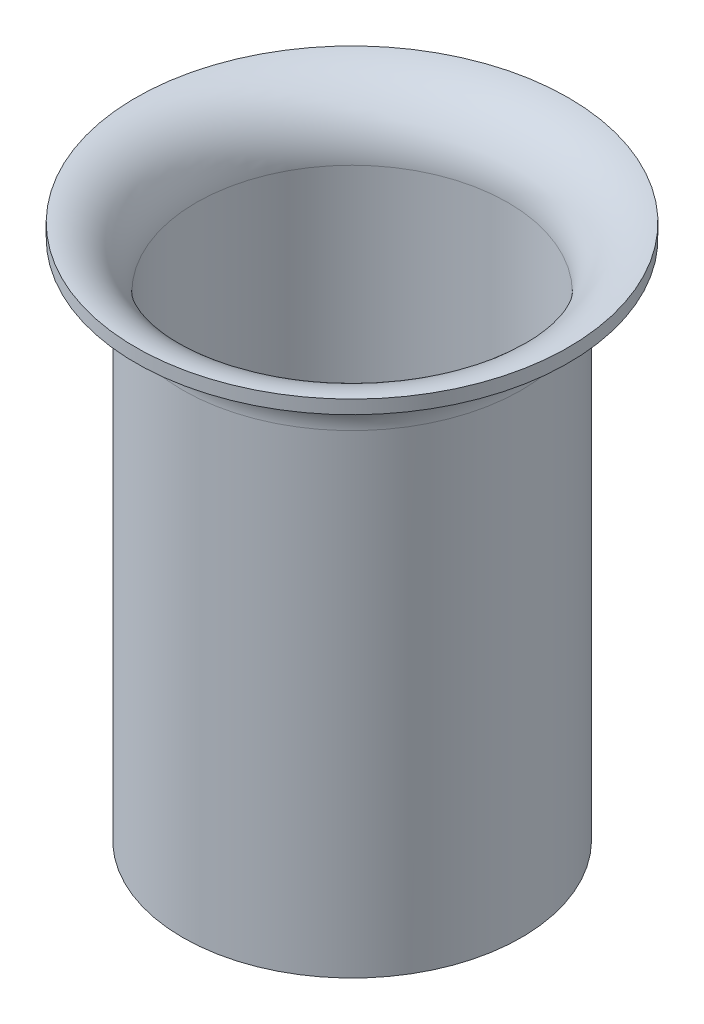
ISO-10303-21;
HEADER;
FILE_DESCRIPTION(('STEP AP214'),'2;1');
FILE_NAME('part.step','',(''),(''),'','','');
FILE_SCHEMA(('AUTOMOTIVE_DESIGN { 1 0 10303 214 1 1 1 1 }'));
ENDSEC;
DATA;
#1=APPLICATION_CONTEXT('core data for automotive mechanical design processes');
#2=APPLICATION_PROTOCOL_DEFINITION('international standard','automotive_design',2000,#1);
#3=PRODUCT_CONTEXT('',#1,'mechanical');
#4=PRODUCT('Part','Part','',(#3));
#5=PRODUCT_RELATED_PRODUCT_CATEGORY('part','',(#4));
#6=PRODUCT_DEFINITION_FORMATION('','',#4);
#7=PRODUCT_DEFINITION_CONTEXT('part definition',#1,'design');
#8=PRODUCT_DEFINITION('design','',#6,#7);
#9=PRODUCT_DEFINITION_SHAPE('','',#8);
#10=(LENGTH_UNIT() NAMED_UNIT(*) SI_UNIT(.MILLI.,.METRE.));
#11=(NAMED_UNIT(*) PLANE_ANGLE_UNIT() SI_UNIT($,.RADIAN.));
#12=(NAMED_UNIT(*) SI_UNIT($,.STERADIAN.) SOLID_ANGLE_UNIT());
#13=UNCERTAINTY_MEASURE_WITH_UNIT(LENGTH_MEASURE(1.E-05),#10,'distance_accuracy_value','');
#14=(GEOMETRIC_REPRESENTATION_CONTEXT(3) GLOBAL_UNCERTAINTY_ASSIGNED_CONTEXT((#13)) GLOBAL_UNIT_ASSIGNED_CONTEXT((#10,
#11,#12)) REPRESENTATION_CONTEXT('',''));
#15=CARTESIAN_POINT('',(0.,0.,0.));
#16=DIRECTION('',(0.,0.,1.));
#17=DIRECTION('',(1.,0.,0.));
#18=AXIS2_PLACEMENT_3D('',#15,#16,#17);
#19=CARTESIAN_POINT('',(0.,0.,0.));
#20=DIRECTION('',(0.,1.,0.));
#21=DIRECTION('',(0.,0.,1.));
#22=AXIS2_PLACEMENT_3D('',#19,#20,#21);
#23=PLANE('',#22);
#24=CARTESIAN_POINT('',(0.,0.,0.));
#25=DIRECTION('',(0.,1.,0.));
#26=DIRECTION('',(0.,0.,1.));
#27=AXIS2_PLACEMENT_3D('',#24,#25,#26);
#28=CIRCLE('',#27,12.5);
#29=CARTESIAN_POINT('',(0.,0.,12.5));
#30=VERTEX_POINT('',#29);
#31=EDGE_CURVE('E33',#30,#30,#28,.T.);
#32=ORIENTED_EDGE('',*,*,#31,.F.);
#33=EDGE_LOOP('',(#32));
#34=FACE_BOUND('',#33,.T.);
#35=CARTESIAN_POINT('',(0.,0.,0.));
#36=DIRECTION('',(0.,1.,0.));
#37=DIRECTION('',(0.,0.,1.));
#38=AXIS2_PLACEMENT_3D('',#35,#36,#37);
#39=CIRCLE('',#38,11.5);
#40=CARTESIAN_POINT('',(0.,0.,11.5));
#41=VERTEX_POINT('',#40);
#42=EDGE_CURVE('E40',#41,#41,#39,.T.);
#43=ORIENTED_EDGE('',*,*,#42,.T.);
#44=EDGE_LOOP('',(#43));
#45=FACE_BOUND('',#44,.T.);
#46=ADVANCED_FACE('F29',(#34,#45),#23,.F.);
#47=CARTESIAN_POINT('',(0.,35.,0.));
#48=DIRECTION('',(0.,-1.,0.));
#49=DIRECTION('',(0.,0.,-1.));
#50=AXIS2_PLACEMENT_3D('',#47,#48,#49);
#51=CYLINDRICAL_SURFACE('',#50,12.5);
#52=CARTESIAN_POINT('',(0.,35.,0.));
#53=DIRECTION('',(0.,1.,0.));
#54=DIRECTION('',(0.,0.,1.));
#55=AXIS2_PLACEMENT_3D('',#52,#53,#54);
#56=CIRCLE('',#55,12.5);
#57=CARTESIAN_POINT('',(0.,35.,12.5));
#58=VERTEX_POINT('',#57);
#59=EDGE_CURVE('E10',#58,#58,#56,.T.);
#60=ORIENTED_EDGE('',*,*,#59,.F.);
#61=EDGE_LOOP('',(#60));
#62=FACE_BOUND('',#61,.T.);
#63=ORIENTED_EDGE('',*,*,#31,.T.);
#64=EDGE_LOOP('',(#63));
#65=FACE_BOUND('',#64,.T.);
#66=ADVANCED_FACE('F31',(#62,#65),#51,.T.);
#67=CARTESIAN_POINT('',(0.,35.,0.));
#68=DIRECTION('',(0.,-1.,0.));
#69=DIRECTION('',(0.,0.,-1.));
#70=AXIS2_PLACEMENT_3D('',#67,#68,#69);
#71=CYLINDRICAL_SURFACE('',#70,11.5);
#72=CARTESIAN_POINT('',(0.,35.,0.));
#73=DIRECTION('',(0.,-1.,0.));
#74=DIRECTION('',(0.,0.,-1.));
#75=AXIS2_PLACEMENT_3D('',#72,#73,#74);
#76=CIRCLE('',#75,11.5);
#77=CARTESIAN_POINT('',(0.,35.,-11.5));
#78=VERTEX_POINT('',#77);
#79=EDGE_CURVE('E44',#78,#78,#76,.T.);
#80=ORIENTED_EDGE('',*,*,#79,.F.);
#81=EDGE_LOOP('',(#80));
#82=FACE_BOUND('',#81,.T.);
#83=ORIENTED_EDGE('',*,*,#42,.F.);
#84=EDGE_LOOP('',(#83));
#85=FACE_BOUND('',#84,.T.);
#86=ADVANCED_FACE('F60',(#82,#85),#71,.F.);
#87=CARTESIAN_POINT('',(0.,35.,0.));
#88=DIRECTION('',(0.,-1.,0.));
#89=DIRECTION('',(0.,0.,-1.));
#90=AXIS2_PLACEMENT_3D('',#87,#88,#89);
#91=TOROIDAL_SURFACE('',#90,15.9680423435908,4.46804234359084);
#92=ORIENTED_EDGE('',*,*,#79,.T.);
#93=EDGE_LOOP('',(#92));
#94=FACE_BOUND('',#93,.T.);
#95=CARTESIAN_POINT('',(0.,39.4680423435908,0.));
#96=DIRECTION('',(0.,-1.,0.));
#97=DIRECTION('',(0.,0.,-1.));
#98=AXIS2_PLACEMENT_3D('',#95,#96,#97);
#99=CIRCLE('',#98,15.9680423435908);
#100=CARTESIAN_POINT('',(0.,39.4680423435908,-15.9680423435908));
#101=VERTEX_POINT('',#100);
#102=EDGE_CURVE('E50',#101,#101,#99,.T.);
#103=ORIENTED_EDGE('',*,*,#102,.F.);
#104=EDGE_LOOP('',(#103));
#105=FACE_BOUND('',#104,.T.);
#106=ADVANCED_FACE('F57',(#94,#105),#91,.T.);
#107=CARTESIAN_POINT('',(0.,35.,0.));
#108=DIRECTION('',(0.,-1.,0.));
#109=DIRECTION('',(0.,0.,-1.));
#110=AXIS2_PLACEMENT_3D('',#107,#108,#109);
#111=TOROIDAL_SURFACE('',#110,15.9680423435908,3.46804234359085);
#112=CARTESIAN_POINT('',(0.,38.4680423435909,0.));
#113=DIRECTION('',(0.,-1.,0.));
#114=DIRECTION('',(0.,0.,-1.));
#115=AXIS2_PLACEMENT_3D('',#112,#113,#114);
#116=CIRCLE('',#115,15.9680423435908);
#117=CARTESIAN_POINT('',(0.,38.4680423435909,-15.9680423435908));
#118=VERTEX_POINT('',#117);
#119=EDGE_CURVE('E47',#118,#118,#116,.T.);
#120=ORIENTED_EDGE('',*,*,#119,.T.);
#121=EDGE_LOOP('',(#120));
#122=FACE_BOUND('',#121,.T.);
#123=ORIENTED_EDGE('',*,*,#59,.T.);
#124=EDGE_LOOP('',(#123));
#125=FACE_BOUND('',#124,.T.);
#126=ADVANCED_FACE('F59',(#122,#125),#111,.F.);
#127=CARTESIAN_POINT('',(0.,35.,0.));
#128=DIRECTION('',(0.,-1.,0.));
#129=DIRECTION('',(0.,0.,-1.));
#130=AXIS2_PLACEMENT_3D('',#127,#128,#129);
#131=CYLINDRICAL_SURFACE('',#130,15.9680423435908);
#132=ORIENTED_EDGE('',*,*,#102,.T.);
#133=EDGE_LOOP('',(#132));
#134=FACE_BOUND('',#133,.T.);
#135=ORIENTED_EDGE('',*,*,#119,.F.);
#136=EDGE_LOOP('',(#135));
#137=FACE_BOUND('',#136,.T.);
#138=ADVANCED_FACE('F54',(#134,#137),#131,.T.);
#139=CLOSED_SHELL('',(#46,#66,#86,#106,#126,#138));
#140=MANIFOLD_SOLID_BREP('B2',#139);
#141=ADVANCED_BREP_SHAPE_REPRESENTATION('',(#18,#140),#14);
#142=SHAPE_DEFINITION_REPRESENTATION(#9,#141);
ENDSEC;
END-ISO-10303-21;
